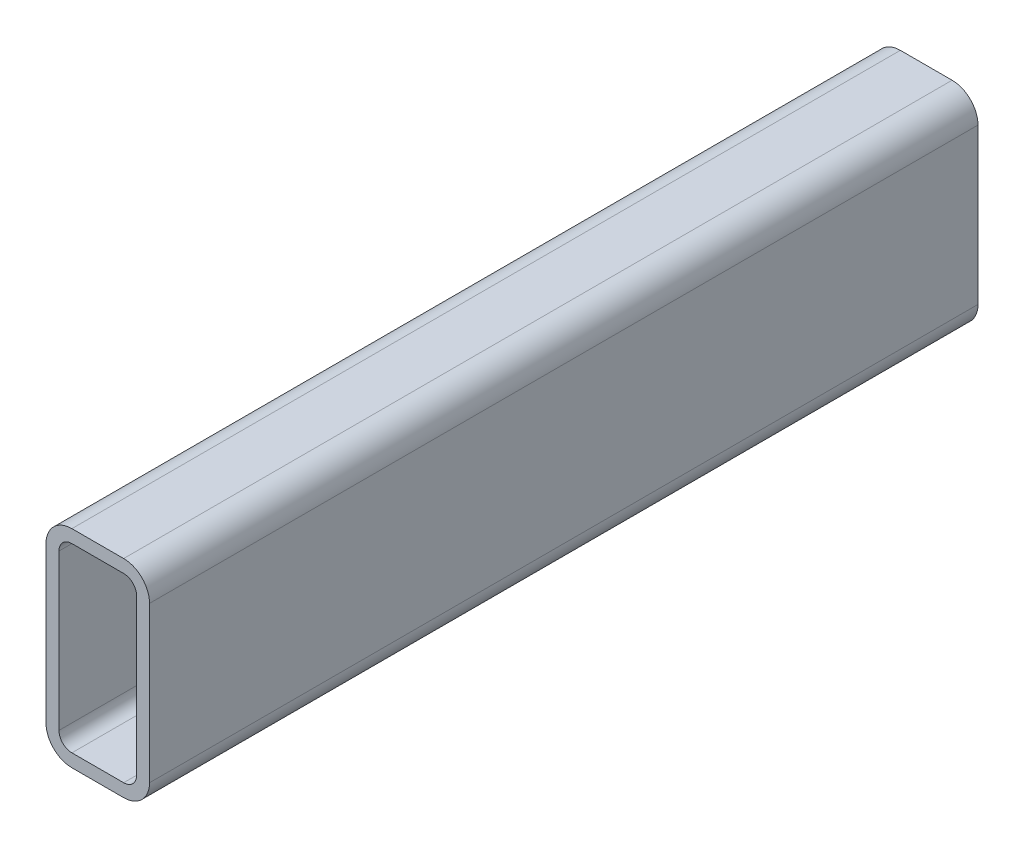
from build123d import *

# Parameters (mm, degrees)
BOSS_EXTRUDE1_DEPTH = 304.8


with BuildPart() as part:
    # Sketch1 → Boss-Extrude1 (new body)
    with BuildSketch(Plane.XY):
        with BuildLine():
            Line((9.525, 76.2), (28.575, 76.2))
            ThreePointArc((28.575, 76.2), (35.310192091, 73.410192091), (38.1, 66.675))
            Line((38.1, 66.675), (38.1, 9.525))
            ThreePointArc((38.1, 9.525), (35.310192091, 2.789807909), (28.575, 0))
            Line((28.575, 0), (9.525, 0))
            ThreePointArc((9.525, 0), (2.789807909, 2.789807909), (0, 9.525))
            Line((0, 9.525), (0, 66.675))
            ThreePointArc((0, 66.675), (2.789807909, 73.410192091), (9.525, 76.2))
        make_face()
        with BuildLine():
            Line((9.525, 71.4375), (28.575, 71.4375))
            ThreePointArc((28.575, 71.4375), (31.942596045, 70.042596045), (33.3375, 66.675))
            Line((33.3375, 66.675), (33.3375, 9.525))
            ThreePointArc((33.3375, 9.525), (31.942596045, 6.157403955), (28.575, 4.7625))
            Line((28.575, 4.7625), (9.525, 4.7625))
            ThreePointArc((9.525, 4.7625), (6.157403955, 6.157403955), (4.7625, 9.525))
            Line((4.7625, 9.525), (4.7625, 66.675))
            ThreePointArc((4.7625, 66.675), (6.157403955, 70.042596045), (9.525, 71.4375))
        make_face(mode=Mode.SUBTRACT)
    extrude(amount=BOSS_EXTRUDE1_DEPTH)


solid = part.part
